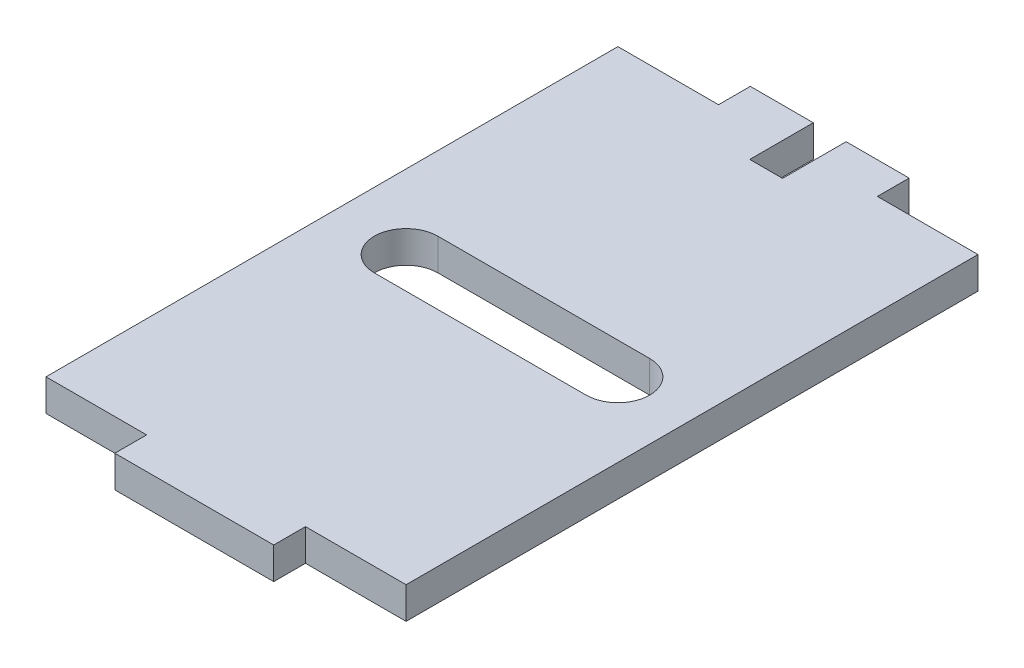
from build123d import *

# Parameters (mm, degrees)
SKETCH1_W           = 34
SKETCH1_H           = 54
BOSS_EXTRUDE1_DEPTH = 3
SKETCH2_W           = 15
SKETCH2_H           = 3
BOSS_EXTRUDE2_DEPTH = 3
CUT_EXTRUDE1_DEPTH  = 3
SKETCH4_W           = 3.1
SKETCH4_H           = 6
CUT_EXTRUDE2_DEPTH  = 10


with BuildPart() as part:
    # Sketch1 → Boss-Extrude1 (new body)
    with BuildSketch(Plane(origin=(0, 0, 0), x_dir=(1, 0, 0), z_dir=(0, 1, 0))):
        Rectangle(SKETCH1_W, SKETCH1_H)
    extrude(amount=BOSS_EXTRUDE1_DEPTH)

    # Sketch2 → Boss-Extrude2 (add)
    with BuildSketch(Plane(origin=(0, 0, 0), x_dir=(1, 0, 0), z_dir=(0, 1, 0))):
        with Locations((0, 28.5)):
            Rectangle(SKETCH2_W, SKETCH2_H)
        with Locations((0, -28.5)):
            Rectangle(SKETCH2_W, SKETCH2_H)
    extrude(amount=BOSS_EXTRUDE2_DEPTH)

    # Sketch3 → Cut-Extrude1 (cut)
    with BuildSketch(Plane(origin=(0, 0, 0), x_dir=(1, 0, 0), z_dir=(0, 1, 0))):
        with BuildLine():
            Line((-10, 3), (10, 3))
            ThreePointArc((10, 3), (13, 0), (10, -3))
            Line((10, -3), (-10, -3))
            ThreePointArc((-10, -3), (-13, 0), (-10, 3))
        make_face()
    extrude(amount=CUT_EXTRUDE1_DEPTH, mode=Mode.SUBTRACT)

    # Sketch4 → Cut-Extrude2 (cut)
    with BuildSketch(Plane(origin=(0, 0, 0), x_dir=(1, 0, 0), z_dir=(0, 1, 0))):
        with Locations((0, 27)):
            Rectangle(SKETCH4_W, SKETCH4_H)
    extrude(amount=CUT_EXTRUDE2_DEPTH, mode=Mode.SUBTRACT)


solid = part.part
